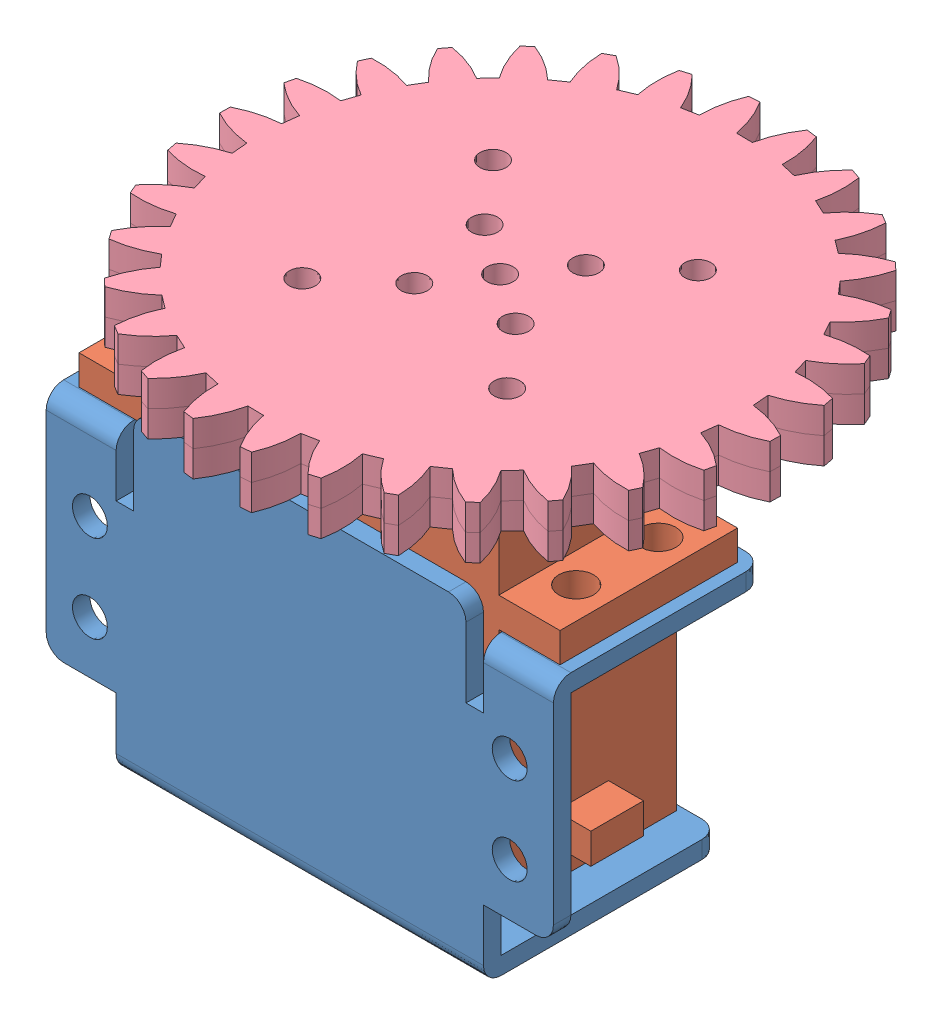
SolidWorks assembly 舵机+舵机架.SLDASM, configuration 默认 (file format 9000). Lengths in mm.
Overall size (90.28 59.1 90.29).
5 component instances, 4 part files, 10 mates.
Components (placement in the parent):
- 舵机金属架-1: 舵机金属架.SLDPRT [默认] at (-7.815 -44.0546 22.1823) size (58 37 27)
- 舵机-1: 舵机.SLDPRT [默认] at (-72.4663 1.4454 12.8463) x (1 0 0) z (0 1 0) size (55 20.3 45.2)
- 舵机盘-1: 舵机盘.SLDPRT [默认] at (-41.4663 9.0454 2.6963) x (-0.837169 0 -0.546944) z (-0.546944 0 0.837169) size (20 4 20)
- M2z20（全）-1: M2z20（全）.SLDPRT [默认] at (-11.6295 9.0454 73.0632) x (0.906632 0 0.421922) z (0 1 0) size (64 63.76 3)
- M2z20（全）-3: M2z20（全）.SLDPRT [默认] at (-42.6531 15.0454 79.1183) x (-0.681436 0 0.731878) z (0 -1 0) size (64 63.76 3)
Mates (geometry in assembly coordinates):
- 同心1: concentric: 舵机金属架-1, 舵机-1
- 重合1: coincident: 舵机金属架-1, 舵机-1
- 平行2: parallel: 舵机金属架-1, 舵机-1
- 同心3: concentric: 舵机-1, 舵机盘-1
- 重合3: coincident: 舵机-1, 舵机盘-1
- 同心4: concentric: 舵机盘-1, M2z20（全）-1
- 重合4: coincident: 舵机盘-1, M2z20（全）-1
- 同心9: concentric: M2z20（全）-1, M2z20（全）-3
- 重合7: coincident: M2z20（全）-1, M2z20（全）-3
- 同心13: concentric: M2z20（全）-1, M2z20（全）-3
